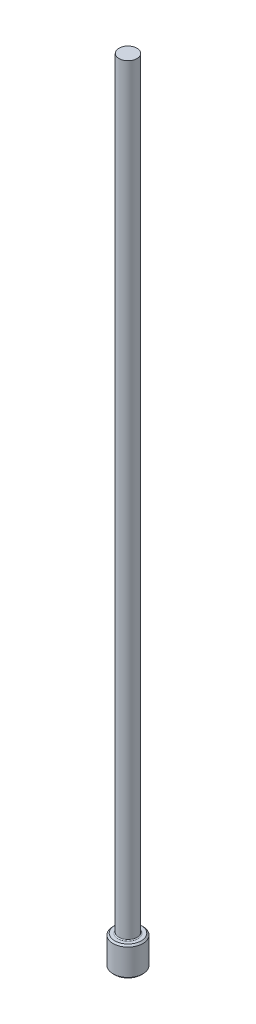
ISO-10303-21;
HEADER;
FILE_DESCRIPTION(('STEP AP214'),'2;1');
FILE_NAME('part.step','',(''),(''),'','','');
FILE_SCHEMA(('AUTOMOTIVE_DESIGN { 1 0 10303 214 1 1 1 1 }'));
ENDSEC;
DATA;
#1=APPLICATION_CONTEXT('core data for automotive mechanical design processes');
#2=APPLICATION_PROTOCOL_DEFINITION('international standard','automotive_design',2000,#1);
#3=PRODUCT_CONTEXT('',#1,'mechanical');
#4=PRODUCT('Part','Part','',(#3));
#5=PRODUCT_RELATED_PRODUCT_CATEGORY('part','',(#4));
#6=PRODUCT_DEFINITION_FORMATION('','',#4);
#7=PRODUCT_DEFINITION_CONTEXT('part definition',#1,'design');
#8=PRODUCT_DEFINITION('design','',#6,#7);
#9=PRODUCT_DEFINITION_SHAPE('','',#8);
#10=(LENGTH_UNIT() NAMED_UNIT(*) SI_UNIT(.MILLI.,.METRE.));
#11=(NAMED_UNIT(*) PLANE_ANGLE_UNIT() SI_UNIT($,.RADIAN.));
#12=(NAMED_UNIT(*) SI_UNIT($,.STERADIAN.) SOLID_ANGLE_UNIT());
#13=UNCERTAINTY_MEASURE_WITH_UNIT(LENGTH_MEASURE(1.E-05),#10,'distance_accuracy_value','');
#14=(GEOMETRIC_REPRESENTATION_CONTEXT(3) GLOBAL_UNCERTAINTY_ASSIGNED_CONTEXT((#13)) GLOBAL_UNIT_ASSIGNED_CONTEXT((#10,
#11,#12)) REPRESENTATION_CONTEXT('',''));
#15=CARTESIAN_POINT('',(0.,0.,0.));
#16=DIRECTION('',(0.,0.,1.));
#17=DIRECTION('',(1.,0.,0.));
#18=AXIS2_PLACEMENT_3D('',#15,#16,#17);
#19=CARTESIAN_POINT('',(0.,0.,0.));
#20=DIRECTION('',(0.,-1.,0.));
#21=DIRECTION('',(0.,0.,-1.));
#22=AXIS2_PLACEMENT_3D('',#19,#20,#21);
#23=PLANE('',#22);
#24=CARTESIAN_POINT('',(0.,0.,0.));
#25=DIRECTION('',(0.,-1.,0.));
#26=DIRECTION('',(0.,0.,-1.));
#27=AXIS2_PLACEMENT_3D('',#24,#25,#26);
#28=CIRCLE('',#27,1.06679999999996);
#29=CARTESIAN_POINT('',(0.,0.,-1.06679999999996));
#30=VERTEX_POINT('',#29);
#31=EDGE_CURVE('E46',#30,#30,#28,.T.);
#32=ORIENTED_EDGE('',*,*,#31,.T.);
#33=EDGE_LOOP('',(#32));
#34=FACE_BOUND('',#33,.T.);
#35=ADVANCED_FACE('F35',(#34),#23,.T.);
#36=CARTESIAN_POINT('',(0.,259.958771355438,0.));
#37=DIRECTION('',(0.,1.,0.));
#38=DIRECTION('',(0.,0.,1.));
#39=AXIS2_PLACEMENT_3D('',#36,#37,#38);
#40=CYLINDRICAL_SURFACE('',#39,1.19379999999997);
#41=CARTESIAN_POINT('',(0.,2.23519999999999,0.));
#42=DIRECTION('',(0.,1.,0.));
#43=DIRECTION('',(0.,0.,1.));
#44=AXIS2_PLACEMENT_3D('',#41,#42,#43);
#45=CIRCLE('',#44,1.19379999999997);
#46=CARTESIAN_POINT('',(0.,2.23519999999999,1.19379999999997));
#47=VERTEX_POINT('',#46);
#48=EDGE_CURVE('E50',#47,#47,#45,.F.);
#49=ORIENTED_EDGE('',*,*,#48,.T.);
#50=EDGE_LOOP('',(#49));
#51=FACE_BOUND('',#50,.T.);
#52=CARTESIAN_POINT('',(0.,0.126999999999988,0.));
#53=DIRECTION('',(0.,-1.,0.));
#54=DIRECTION('',(0.,0.,-1.));
#55=AXIS2_PLACEMENT_3D('',#52,#53,#54);
#56=CIRCLE('',#55,1.19379999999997);
#57=CARTESIAN_POINT('',(0.,0.126999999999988,-1.19379999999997));
#58=VERTEX_POINT('',#57);
#59=EDGE_CURVE('E55',#58,#58,#56,.F.);
#60=ORIENTED_EDGE('',*,*,#59,.T.);
#61=EDGE_LOOP('',(#60));
#62=FACE_BOUND('',#61,.T.);
#63=ADVANCED_FACE('F77',(#51,#62),#40,.T.);
#64=CARTESIAN_POINT('',(-1.19379999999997,2.3622,0.));
#65=DIRECTION('',(0.,1.,0.));
#66=DIRECTION('',(0.,0.,1.));
#67=AXIS2_PLACEMENT_3D('',#64,#65,#66);
#68=PLANE('',#67);
#69=CARTESIAN_POINT('',(0.,2.3622,0.));
#70=DIRECTION('',(0.,1.,0.));
#71=DIRECTION('',(0.,0.,1.));
#72=AXIS2_PLACEMENT_3D('',#69,#70,#71);
#73=CIRCLE('',#72,0.800099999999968);
#74=CARTESIAN_POINT('',(0.,2.3622,0.800099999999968));
#75=VERTEX_POINT('',#74);
#76=EDGE_CURVE('E10',#75,#75,#73,.F.);
#77=ORIENTED_EDGE('',*,*,#76,.T.);
#78=EDGE_LOOP('',(#77));
#79=FACE_BOUND('',#78,.T.);
#80=CARTESIAN_POINT('',(0.,2.3622,0.));
#81=DIRECTION('',(0.,1.,0.));
#82=DIRECTION('',(0.,0.,1.));
#83=AXIS2_PLACEMENT_3D('',#80,#81,#82);
#84=CIRCLE('',#83,1.06679999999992);
#85=CARTESIAN_POINT('',(0.,2.3622,1.06679999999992));
#86=VERTEX_POINT('',#85);
#87=EDGE_CURVE('E58',#86,#86,#84,.T.);
#88=ORIENTED_EDGE('',*,*,#87,.T.);
#89=EDGE_LOOP('',(#88));
#90=FACE_BOUND('',#89,.T.);
#91=ADVANCED_FACE('F69',(#79,#90),#68,.T.);
#92=CARTESIAN_POINT('',(0.,259.958771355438,0.));
#93=DIRECTION('',(0.,1.,0.));
#94=DIRECTION('',(0.,0.,1.));
#95=AXIS2_PLACEMENT_3D('',#92,#93,#94);
#96=CYLINDRICAL_SURFACE('',#95,0.723899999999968);
#97=CARTESIAN_POINT('',(0.,2.43840000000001,0.));
#98=DIRECTION('',(0.,1.,0.));
#99=DIRECTION('',(0.,0.,1.));
#100=AXIS2_PLACEMENT_3D('',#97,#98,#99);
#101=CIRCLE('',#100,0.723899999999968);
#102=CARTESIAN_POINT('',(0.,2.43840000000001,0.723899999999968));
#103=VERTEX_POINT('',#102);
#104=EDGE_CURVE('E42',#103,#103,#101,.T.);
#105=ORIENTED_EDGE('',*,*,#104,.T.);
#106=EDGE_LOOP('',(#105));
#107=FACE_BOUND('',#106,.T.);
#108=CARTESIAN_POINT('',(0.,63.5,0.));
#109=DIRECTION('',(0.,1.,0.));
#110=DIRECTION('',(0.,0.,1.));
#111=AXIS2_PLACEMENT_3D('',#108,#109,#110);
#112=CIRCLE('',#111,0.723899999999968);
#113=CARTESIAN_POINT('',(0.,63.5,0.723899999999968));
#114=VERTEX_POINT('',#113);
#115=EDGE_CURVE('E61',#114,#114,#112,.T.);
#116=ORIENTED_EDGE('',*,*,#115,.F.);
#117=EDGE_LOOP('',(#116));
#118=FACE_BOUND('',#117,.T.);
#119=ADVANCED_FACE('F67',(#107,#118),#96,.T.);
#120=CARTESIAN_POINT('',(-0.723899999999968,63.5,0.));
#121=DIRECTION('',(0.,1.,0.));
#122=DIRECTION('',(0.,0.,1.));
#123=AXIS2_PLACEMENT_3D('',#120,#121,#122);
#124=PLANE('',#123);
#125=ORIENTED_EDGE('',*,*,#115,.T.);
#126=EDGE_LOOP('',(#125));
#127=FACE_BOUND('',#126,.T.);
#128=ADVANCED_FACE('F65',(#127),#124,.T.);
#129=CARTESIAN_POINT('',(0.,2.36219999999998,0.));
#130=DIRECTION('',(0.,-1.,0.));
#131=DIRECTION('',(0.,0.,-1.));
#132=AXIS2_PLACEMENT_3D('',#129,#130,#131);
#133=CONICAL_SURFACE('',#132,1.06679999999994,0.785398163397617);
#134=ORIENTED_EDGE('',*,*,#48,.F.);
#135=EDGE_LOOP('',(#134));
#136=FACE_BOUND('',#135,.T.);
#137=ORIENTED_EDGE('',*,*,#87,.F.);
#138=EDGE_LOOP('',(#137));
#139=FACE_BOUND('',#138,.T.);
#140=ADVANCED_FACE('F75',(#136,#139),#133,.T.);
#141=CARTESIAN_POINT('',(0.,0.126999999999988,0.));
#142=DIRECTION('',(0.,1.,0.));
#143=DIRECTION('',(0.,0.,1.));
#144=AXIS2_PLACEMENT_3D('',#141,#142,#143);
#145=CONICAL_SURFACE('',#144,1.19379999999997,0.785398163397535);
#146=ORIENTED_EDGE('',*,*,#31,.F.);
#147=EDGE_LOOP('',(#146));
#148=FACE_BOUND('',#147,.T.);
#149=ORIENTED_EDGE('',*,*,#59,.F.);
#150=EDGE_LOOP('',(#149));
#151=FACE_BOUND('',#150,.T.);
#152=ADVANCED_FACE('F89',(#148,#151),#145,.T.);
#153=CARTESIAN_POINT('',(0.,2.43840000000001,0.));
#154=DIRECTION('',(0.,1.,0.));
#155=DIRECTION('',(0.,0.,1.));
#156=AXIS2_PLACEMENT_3D('',#153,#154,#155);
#157=TOROIDAL_SURFACE('',#156,0.800099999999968,0.0762);
#158=ORIENTED_EDGE('',*,*,#76,.F.);
#159=EDGE_LOOP('',(#158));
#160=FACE_BOUND('',#159,.T.);
#161=ORIENTED_EDGE('',*,*,#104,.F.);
#162=EDGE_LOOP('',(#161));
#163=FACE_BOUND('',#162,.T.);
#164=ADVANCED_FACE('F37',(#160,#163),#157,.F.);
#165=CLOSED_SHELL('',(#35,#63,#91,#119,#128,#140,#152,#164));
#166=MANIFOLD_SOLID_BREP('B2',#165);
#167=ADVANCED_BREP_SHAPE_REPRESENTATION('',(#18,#166),#14);
#168=SHAPE_DEFINITION_REPRESENTATION(#9,#167);
ENDSEC;
END-ISO-10303-21;
